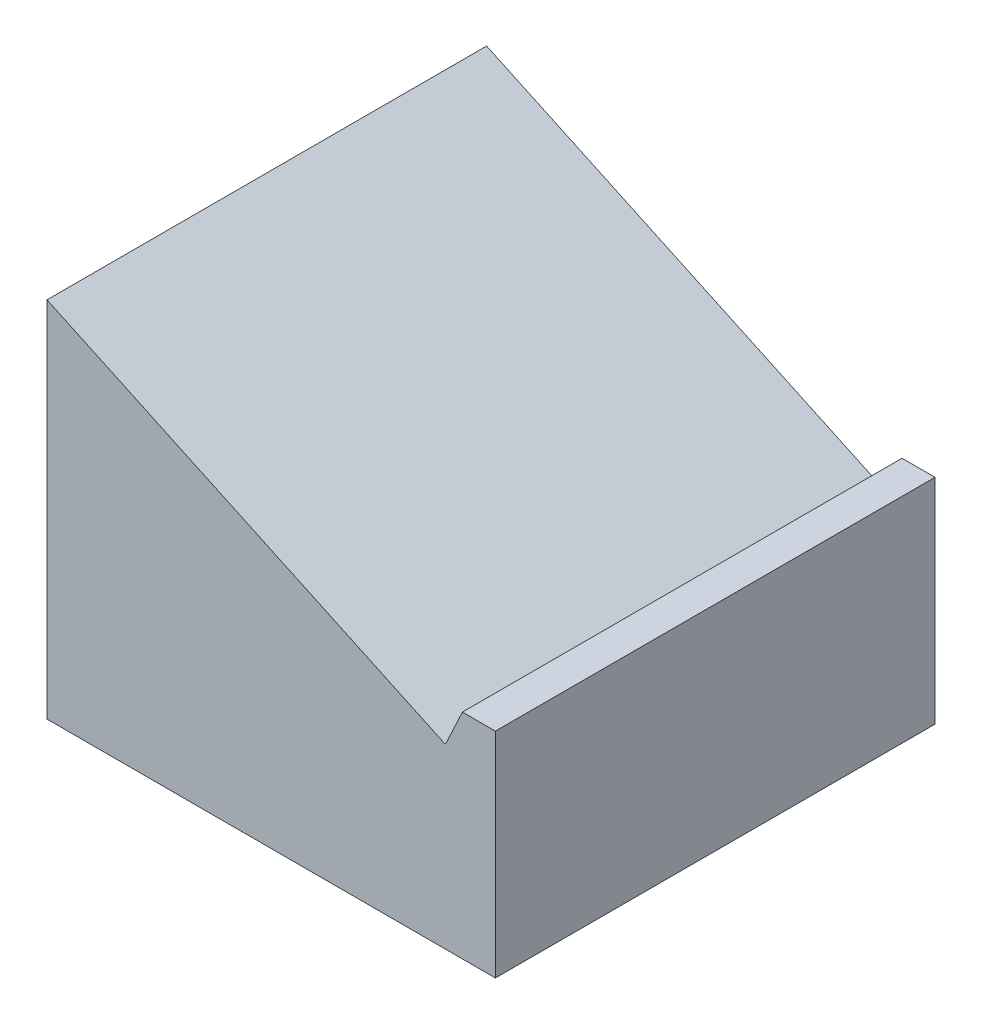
ISO-10303-21;
HEADER;
FILE_DESCRIPTION(('STEP AP214'),'2;1');
FILE_NAME('part.step','',(''),(''),'','','');
FILE_SCHEMA(('AUTOMOTIVE_DESIGN { 1 0 10303 214 1 1 1 1 }'));
ENDSEC;
DATA;
#1=APPLICATION_CONTEXT('core data for automotive mechanical design processes');
#2=APPLICATION_PROTOCOL_DEFINITION('international standard','automotive_design',2000,#1);
#3=PRODUCT_CONTEXT('',#1,'mechanical');
#4=PRODUCT('Part','Part','',(#3));
#5=PRODUCT_RELATED_PRODUCT_CATEGORY('part','',(#4));
#6=PRODUCT_DEFINITION_FORMATION('','',#4);
#7=PRODUCT_DEFINITION_CONTEXT('part definition',#1,'design');
#8=PRODUCT_DEFINITION('design','',#6,#7);
#9=PRODUCT_DEFINITION_SHAPE('','',#8);
#10=(LENGTH_UNIT() NAMED_UNIT(*) SI_UNIT(.MILLI.,.METRE.));
#11=(NAMED_UNIT(*) PLANE_ANGLE_UNIT() SI_UNIT($,.RADIAN.));
#12=(NAMED_UNIT(*) SI_UNIT($,.STERADIAN.) SOLID_ANGLE_UNIT());
#13=UNCERTAINTY_MEASURE_WITH_UNIT(LENGTH_MEASURE(1.E-05),#10,'distance_accuracy_value','');
#14=(GEOMETRIC_REPRESENTATION_CONTEXT(3) GLOBAL_UNCERTAINTY_ASSIGNED_CONTEXT((#13)) GLOBAL_UNIT_ASSIGNED_CONTEXT((#10,
#11,#12)) REPRESENTATION_CONTEXT('',''));
#15=CARTESIAN_POINT('',(0.,0.,0.));
#16=DIRECTION('',(0.,0.,1.));
#17=DIRECTION('',(1.,0.,0.));
#18=AXIS2_PLACEMENT_3D('',#15,#16,#17);
#19=CARTESIAN_POINT('',(-2.88778220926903,10.2458961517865,25.4));
#20=DIRECTION('',(-0.422618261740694,-0.906307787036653,0.));
#21=DIRECTION('',(0.906307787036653,-0.422618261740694,0.));
#22=AXIS2_PLACEMENT_3D('',#19,#20,#21);
#23=PLANE('',#22);
#24=DIRECTION('',(-0.906307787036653,0.422618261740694,0.));
#25=VECTOR('',#24,1.);
#26=CARTESIAN_POINT('',(-2.88778220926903,10.2458961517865,0.));
#27=LINE('',#26,#25);
#28=CARTESIAN_POINT('',(-2.88778220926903,10.2458961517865,0.));
#29=VERTEX_POINT('',#28);
#30=CARTESIAN_POINT('',(-25.908,20.9804000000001,0.));
#31=VERTEX_POINT('',#30);
#32=EDGE_CURVE('E91',#29,#31,#27,.T.);
#33=ORIENTED_EDGE('',*,*,#32,.T.);
#34=DIRECTION('',(0.,0.,-1.));
#35=VECTOR('',#34,1.);
#36=CARTESIAN_POINT('',(-25.908,20.9804000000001,25.4));
#37=LINE('',#36,#35);
#38=CARTESIAN_POINT('',(-25.908,20.9804000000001,25.4));
#39=VERTEX_POINT('',#38);
#40=EDGE_CURVE('E11',#39,#31,#37,.T.);
#41=ORIENTED_EDGE('',*,*,#40,.F.);
#42=DIRECTION('',(-0.906307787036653,0.422618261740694,0.));
#43=VECTOR('',#42,1.);
#44=CARTESIAN_POINT('',(-2.88778220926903,10.2458961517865,25.4));
#45=LINE('',#44,#43);
#46=CARTESIAN_POINT('',(-2.88778220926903,10.2458961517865,25.4));
#47=VERTEX_POINT('',#46);
#48=EDGE_CURVE('E114',#47,#39,#45,.T.);
#49=ORIENTED_EDGE('',*,*,#48,.F.);
#50=DIRECTION('',(0.,0.,-1.));
#51=VECTOR('',#50,1.);
#52=CARTESIAN_POINT('',(-2.88778220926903,10.2458961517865,25.4));
#53=LINE('',#52,#51);
#54=EDGE_CURVE('E104',#47,#29,#53,.T.);
#55=ORIENTED_EDGE('',*,*,#54,.T.);
#56=EDGE_LOOP('',(#33,#41,#49,#55));
#57=FACE_BOUND('',#56,.T.);
#58=ADVANCED_FACE('F35',(#57),#23,.F.);
#59=CARTESIAN_POINT('',(-25.908,20.9804000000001,25.4));
#60=DIRECTION('',(1.,0.,0.));
#61=DIRECTION('',(0.,1.,0.));
#62=AXIS2_PLACEMENT_3D('',#59,#60,#61);
#63=PLANE('',#62);
#64=DIRECTION('',(0.,-1.,0.));
#65=VECTOR('',#64,1.);
#66=CARTESIAN_POINT('',(-25.908,20.9804000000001,0.));
#67=LINE('',#66,#65);
#68=CARTESIAN_POINT('',(-25.908,1.31838984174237E-13,0.));
#69=VERTEX_POINT('',#68);
#70=EDGE_CURVE('E87',#31,#69,#67,.T.);
#71=ORIENTED_EDGE('',*,*,#70,.T.);
#72=DIRECTION('',(0.,0.,-1.));
#73=VECTOR('',#72,1.);
#74=CARTESIAN_POINT('',(-25.908,1.31838984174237E-13,25.4));
#75=LINE('',#74,#73);
#76=CARTESIAN_POINT('',(-25.908,1.31838984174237E-13,25.4));
#77=VERTEX_POINT('',#76);
#78=EDGE_CURVE('E42',#77,#69,#75,.T.);
#79=ORIENTED_EDGE('',*,*,#78,.F.);
#80=DIRECTION('',(0.,-1.,0.));
#81=VECTOR('',#80,1.);
#82=CARTESIAN_POINT('',(-25.908,20.9804000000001,25.4));
#83=LINE('',#82,#81);
#84=EDGE_CURVE('E100',#39,#77,#83,.T.);
#85=ORIENTED_EDGE('',*,*,#84,.F.);
#86=ORIENTED_EDGE('',*,*,#40,.T.);
#87=EDGE_LOOP('',(#71,#79,#85,#86));
#88=FACE_BOUND('',#87,.T.);
#89=ADVANCED_FACE('F99',(#88),#63,.F.);
#90=CARTESIAN_POINT('',(-25.908,1.31838984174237E-13,25.4));
#91=DIRECTION('',(0.,1.,0.));
#92=DIRECTION('',(-1.,0.,0.));
#93=AXIS2_PLACEMENT_3D('',#90,#91,#92);
#94=PLANE('',#93);
#95=DIRECTION('',(1.,0.,0.));
#96=VECTOR('',#95,1.);
#97=CARTESIAN_POINT('',(-25.908,1.31838984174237E-13,0.));
#98=LINE('',#97,#96);
#99=CARTESIAN_POINT('',(0.,0.,0.));
#100=VERTEX_POINT('',#99);
#101=EDGE_CURVE('E93',#69,#100,#98,.T.);
#102=ORIENTED_EDGE('',*,*,#101,.T.);
#103=DIRECTION('',(0.,0.,-1.));
#104=VECTOR('',#103,1.);
#105=CARTESIAN_POINT('',(0.,0.,25.4));
#106=LINE('',#105,#104);
#107=CARTESIAN_POINT('',(0.,0.,25.4));
#108=VERTEX_POINT('',#107);
#109=EDGE_CURVE('E130',#108,#100,#106,.T.);
#110=ORIENTED_EDGE('',*,*,#109,.F.);
#111=DIRECTION('',(1.,0.,0.));
#112=VECTOR('',#111,1.);
#113=CARTESIAN_POINT('',(-25.908,1.31838984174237E-13,25.4));
#114=LINE('',#113,#112);
#115=EDGE_CURVE('E117',#77,#108,#114,.T.);
#116=ORIENTED_EDGE('',*,*,#115,.F.);
#117=ORIENTED_EDGE('',*,*,#78,.T.);
#118=EDGE_LOOP('',(#102,#110,#116,#117));
#119=FACE_BOUND('',#118,.T.);
#120=ADVANCED_FACE('F134',(#119),#94,.F.);
#121=CARTESIAN_POINT('',(0.,0.,25.4));
#122=DIRECTION('',(-1.,0.,0.));
#123=DIRECTION('',(0.,0.,1.));
#124=AXIS2_PLACEMENT_3D('',#121,#122,#123);
#125=PLANE('',#124);
#126=DIRECTION('',(0.,1.,0.));
#127=VECTOR('',#126,1.);
#128=CARTESIAN_POINT('',(0.,0.,0.));
#129=LINE('',#128,#127);
#130=CARTESIAN_POINT('',(0.,12.3534794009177,0.));
#131=VERTEX_POINT('',#130);
#132=EDGE_CURVE('E108',#100,#131,#129,.T.);
#133=ORIENTED_EDGE('',*,*,#132,.T.);
#134=DIRECTION('',(0.,0.,-1.));
#135=VECTOR('',#134,1.);
#136=CARTESIAN_POINT('',(0.,12.3534794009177,25.4));
#137=LINE('',#136,#135);
#138=CARTESIAN_POINT('',(0.,12.3534794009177,25.4));
#139=VERTEX_POINT('',#138);
#140=EDGE_CURVE('E127',#139,#131,#137,.T.);
#141=ORIENTED_EDGE('',*,*,#140,.F.);
#142=DIRECTION('',(0.,1.,0.));
#143=VECTOR('',#142,1.);
#144=CARTESIAN_POINT('',(0.,0.,25.4));
#145=LINE('',#144,#143);
#146=EDGE_CURVE('E119',#108,#139,#145,.T.);
#147=ORIENTED_EDGE('',*,*,#146,.F.);
#148=ORIENTED_EDGE('',*,*,#109,.T.);
#149=EDGE_LOOP('',(#133,#141,#147,#148));
#150=FACE_BOUND('',#149,.T.);
#151=ADVANCED_FACE('F140',(#150),#125,.F.);
#152=CARTESIAN_POINT('',(0.,12.3534794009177,25.4));
#153=DIRECTION('',(0.,-1.,0.));
#154=DIRECTION('',(1.,0.,0.));
#155=AXIS2_PLACEMENT_3D('',#152,#153,#154);
#156=PLANE('',#155);
#157=DIRECTION('',(-1.,0.,0.));
#158=VECTOR('',#157,1.);
#159=CARTESIAN_POINT('',(0.,12.3534794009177,0.));
#160=LINE('',#159,#158);
#161=CARTESIAN_POINT('',(-1.90499999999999,12.3534794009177,0.));
#162=VERTEX_POINT('',#161);
#163=EDGE_CURVE('E110',#131,#162,#160,.T.);
#164=ORIENTED_EDGE('',*,*,#163,.T.);
#165=DIRECTION('',(0.,0.,-1.));
#166=VECTOR('',#165,1.);
#167=CARTESIAN_POINT('',(-1.90499999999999,12.3534794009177,25.4));
#168=LINE('',#167,#166);
#169=CARTESIAN_POINT('',(-1.90499999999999,12.3534794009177,25.4));
#170=VERTEX_POINT('',#169);
#171=EDGE_CURVE('E124',#170,#162,#168,.T.);
#172=ORIENTED_EDGE('',*,*,#171,.F.);
#173=DIRECTION('',(-1.,0.,0.));
#174=VECTOR('',#173,1.);
#175=CARTESIAN_POINT('',(0.,12.3534794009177,25.4));
#176=LINE('',#175,#174);
#177=EDGE_CURVE('E54',#139,#170,#176,.T.);
#178=ORIENTED_EDGE('',*,*,#177,.F.);
#179=ORIENTED_EDGE('',*,*,#140,.T.);
#180=EDGE_LOOP('',(#164,#172,#178,#179));
#181=FACE_BOUND('',#180,.T.);
#182=ADVANCED_FACE('F143',(#181),#156,.F.);
#183=CARTESIAN_POINT('',(-1.90499999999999,12.3534794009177,25.4));
#184=DIRECTION('',(0.906307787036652,-0.422618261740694,0.));
#185=DIRECTION('',(0.422618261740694,0.906307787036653,0.));
#186=AXIS2_PLACEMENT_3D('',#183,#184,#185);
#187=PLANE('',#186);
#188=DIRECTION('',(-0.422618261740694,-0.906307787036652,0.));
#189=VECTOR('',#188,1.);
#190=CARTESIAN_POINT('',(-1.90499999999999,12.3534794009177,0.));
#191=LINE('',#190,#189);
#192=EDGE_CURVE('E112',#162,#29,#191,.T.);
#193=ORIENTED_EDGE('',*,*,#192,.T.);
#194=ORIENTED_EDGE('',*,*,#54,.F.);
#195=DIRECTION('',(-0.422618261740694,-0.906307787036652,0.));
#196=VECTOR('',#195,1.);
#197=CARTESIAN_POINT('',(-1.90499999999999,12.3534794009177,25.4));
#198=LINE('',#197,#196);
#199=EDGE_CURVE('E49',#170,#47,#198,.T.);
#200=ORIENTED_EDGE('',*,*,#199,.F.);
#201=ORIENTED_EDGE('',*,*,#171,.T.);
#202=EDGE_LOOP('',(#193,#194,#200,#201));
#203=FACE_BOUND('',#202,.T.);
#204=ADVANCED_FACE('F145',(#203),#187,.F.);
#205=CARTESIAN_POINT('',(-2.88778220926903,10.2458961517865,25.4));
#206=DIRECTION('',(0.,0.,1.));
#207=DIRECTION('',(1.,0.,0.));
#208=AXIS2_PLACEMENT_3D('',#205,#206,#207);
#209=PLANE('',#208);
#210=ORIENTED_EDGE('',*,*,#48,.T.);
#211=ORIENTED_EDGE('',*,*,#84,.T.);
#212=ORIENTED_EDGE('',*,*,#115,.T.);
#213=ORIENTED_EDGE('',*,*,#146,.T.);
#214=ORIENTED_EDGE('',*,*,#177,.T.);
#215=ORIENTED_EDGE('',*,*,#199,.T.);
#216=EDGE_LOOP('',(#210,#211,#212,#213,#214,#215));
#217=FACE_BOUND('',#216,.T.);
#218=ADVANCED_FACE('F137',(#217),#209,.T.);
#219=CARTESIAN_POINT('',(-2.88778220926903,10.2458961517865,0.));
#220=DIRECTION('',(0.,0.,1.));
#221=DIRECTION('',(1.,0.,0.));
#222=AXIS2_PLACEMENT_3D('',#219,#220,#221);
#223=PLANE('',#222);
#224=ORIENTED_EDGE('',*,*,#32,.F.);
#225=ORIENTED_EDGE('',*,*,#192,.F.);
#226=ORIENTED_EDGE('',*,*,#163,.F.);
#227=ORIENTED_EDGE('',*,*,#132,.F.);
#228=ORIENTED_EDGE('',*,*,#101,.F.);
#229=ORIENTED_EDGE('',*,*,#70,.F.);
#230=EDGE_LOOP('',(#224,#225,#226,#227,#228,#229));
#231=FACE_BOUND('',#230,.T.);
#232=ADVANCED_FACE('F88',(#231),#223,.F.);
#233=CLOSED_SHELL('',(#58,#89,#120,#151,#182,#204,#218,#232));
#234=MANIFOLD_SOLID_BREP('B2',#233);
#235=ADVANCED_BREP_SHAPE_REPRESENTATION('',(#18,#234),#14);
#236=SHAPE_DEFINITION_REPRESENTATION(#9,#235);
ENDSEC;
END-ISO-10303-21;
